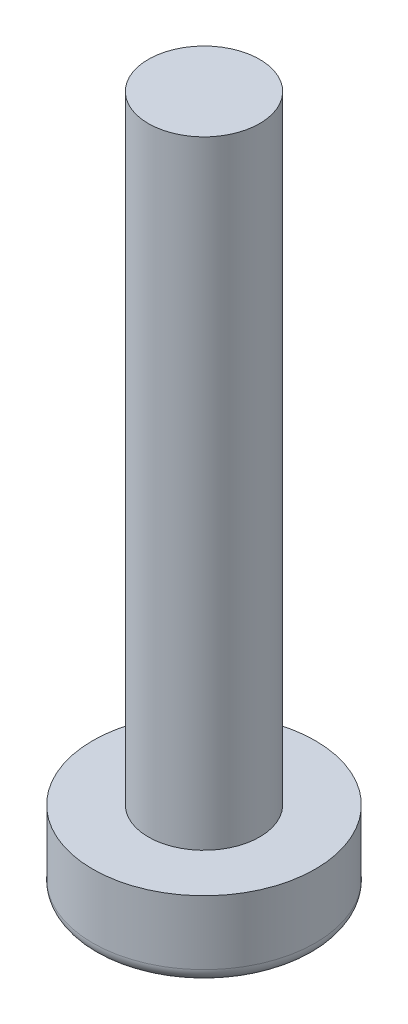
ISO-10303-21;
HEADER;
FILE_DESCRIPTION(('STEP AP214'),'2;1');
FILE_NAME('part.step','',(''),(''),'','','');
FILE_SCHEMA(('AUTOMOTIVE_DESIGN { 1 0 10303 214 1 1 1 1 }'));
ENDSEC;
DATA;
#1=APPLICATION_CONTEXT('core data for automotive mechanical design processes');
#2=APPLICATION_PROTOCOL_DEFINITION('international standard','automotive_design',2000,#1);
#3=PRODUCT_CONTEXT('',#1,'mechanical');
#4=PRODUCT('Part','Part','',(#3));
#5=PRODUCT_RELATED_PRODUCT_CATEGORY('part','',(#4));
#6=PRODUCT_DEFINITION_FORMATION('','',#4);
#7=PRODUCT_DEFINITION_CONTEXT('part definition',#1,'design');
#8=PRODUCT_DEFINITION('design','',#6,#7);
#9=PRODUCT_DEFINITION_SHAPE('','',#8);
#10=(LENGTH_UNIT() NAMED_UNIT(*) SI_UNIT(.MILLI.,.METRE.));
#11=(NAMED_UNIT(*) PLANE_ANGLE_UNIT() SI_UNIT($,.RADIAN.));
#12=(NAMED_UNIT(*) SI_UNIT($,.STERADIAN.) SOLID_ANGLE_UNIT());
#13=UNCERTAINTY_MEASURE_WITH_UNIT(LENGTH_MEASURE(1.E-05),#10,'distance_accuracy_value','');
#14=(GEOMETRIC_REPRESENTATION_CONTEXT(3) GLOBAL_UNCERTAINTY_ASSIGNED_CONTEXT((#13)) GLOBAL_UNIT_ASSIGNED_CONTEXT((#10,
#11,#12)) REPRESENTATION_CONTEXT('',''));
#15=CARTESIAN_POINT('',(0.,0.,0.));
#16=DIRECTION('',(0.,0.,1.));
#17=DIRECTION('',(1.,0.,0.));
#18=AXIS2_PLACEMENT_3D('',#15,#16,#17);
#19=CARTESIAN_POINT('',(0.,0.,0.));
#20=DIRECTION('',(0.,1.,0.));
#21=DIRECTION('',(0.,0.,1.));
#22=AXIS2_PLACEMENT_3D('',#19,#20,#21);
#23=PLANE('',#22);
#24=CARTESIAN_POINT('',(0.,0.,0.));
#25=DIRECTION('',(0.,1.,0.));
#26=DIRECTION('',(0.,0.,1.));
#27=AXIS2_PLACEMENT_3D('',#24,#25,#26);
#28=CIRCLE('',#27,3.5);
#29=CARTESIAN_POINT('',(0.,0.,3.5));
#30=VERTEX_POINT('',#29);
#31=EDGE_CURVE('E11',#30,#30,#28,.F.);
#32=ORIENTED_EDGE('',*,*,#31,.T.);
#33=EDGE_LOOP('',(#32));
#34=FACE_BOUND('',#33,.T.);
#35=ADVANCED_FACE('F47',(#34),#23,.F.);
#36=CARTESIAN_POINT('',(0.,2.8,0.));
#37=DIRECTION('',(0.,-1.,0.));
#38=DIRECTION('',(0.,0.,-1.));
#39=AXIS2_PLACEMENT_3D('',#36,#37,#38);
#40=CYLINDRICAL_SURFACE('',#39,4.);
#41=CARTESIAN_POINT('',(0.,0.5,0.));
#42=DIRECTION('',(0.,1.,0.));
#43=DIRECTION('',(0.,0.,1.));
#44=AXIS2_PLACEMENT_3D('',#41,#42,#43);
#45=CIRCLE('',#44,4.);
#46=CARTESIAN_POINT('',(0.,0.5,4.));
#47=VERTEX_POINT('',#46);
#48=EDGE_CURVE('E60',#47,#47,#45,.T.);
#49=ORIENTED_EDGE('',*,*,#48,.T.);
#50=EDGE_LOOP('',(#49));
#51=FACE_BOUND('',#50,.T.);
#52=CARTESIAN_POINT('',(0.,2.8,0.));
#53=DIRECTION('',(0.,1.,0.));
#54=DIRECTION('',(0.,0.,1.));
#55=AXIS2_PLACEMENT_3D('',#52,#53,#54);
#56=CIRCLE('',#55,4.);
#57=CARTESIAN_POINT('',(0.,2.8,4.));
#58=VERTEX_POINT('',#57);
#59=EDGE_CURVE('E67',#58,#58,#56,.T.);
#60=ORIENTED_EDGE('',*,*,#59,.F.);
#61=EDGE_LOOP('',(#60));
#62=FACE_BOUND('',#61,.T.);
#63=ADVANCED_FACE('F90',(#51,#62),#40,.T.);
#64=CARTESIAN_POINT('',(0.,2.8,0.));
#65=DIRECTION('',(0.,1.,0.));
#66=DIRECTION('',(0.,0.,1.));
#67=AXIS2_PLACEMENT_3D('',#64,#65,#66);
#68=PLANE('',#67);
#69=CARTESIAN_POINT('',(0.,2.8,0.));
#70=DIRECTION('',(0.,1.,0.));
#71=DIRECTION('',(0.,0.,1.));
#72=AXIS2_PLACEMENT_3D('',#69,#70,#71);
#73=CIRCLE('',#72,2.);
#74=CARTESIAN_POINT('',(0.,2.8,2.));
#75=VERTEX_POINT('',#74);
#76=EDGE_CURVE('E64',#75,#75,#73,.T.);
#77=ORIENTED_EDGE('',*,*,#76,.F.);
#78=EDGE_LOOP('',(#77));
#79=FACE_BOUND('',#78,.T.);
#80=ORIENTED_EDGE('',*,*,#59,.T.);
#81=EDGE_LOOP('',(#80));
#82=FACE_BOUND('',#81,.T.);
#83=ADVANCED_FACE('F84',(#79,#82),#68,.T.);
#84=CARTESIAN_POINT('',(0.,25.,0.));
#85=DIRECTION('',(0.,-1.,0.));
#86=DIRECTION('',(0.,0.,-1.));
#87=AXIS2_PLACEMENT_3D('',#84,#85,#86);
#88=CYLINDRICAL_SURFACE('',#87,2.);
#89=CARTESIAN_POINT('',(0.,25.,0.));
#90=DIRECTION('',(0.,1.,0.));
#91=DIRECTION('',(0.,0.,1.));
#92=AXIS2_PLACEMENT_3D('',#89,#90,#91);
#93=CIRCLE('',#92,2.);
#94=CARTESIAN_POINT('',(0.,25.,2.));
#95=VERTEX_POINT('',#94);
#96=EDGE_CURVE('E75',#95,#95,#93,.T.);
#97=ORIENTED_EDGE('',*,*,#96,.F.);
#98=EDGE_LOOP('',(#97));
#99=FACE_BOUND('',#98,.T.);
#100=ORIENTED_EDGE('',*,*,#76,.T.);
#101=EDGE_LOOP('',(#100));
#102=FACE_BOUND('',#101,.T.);
#103=ADVANCED_FACE('F76',(#99,#102),#88,.T.);
#104=CARTESIAN_POINT('',(0.,25.,0.));
#105=DIRECTION('',(0.,1.,0.));
#106=DIRECTION('',(0.,0.,1.));
#107=AXIS2_PLACEMENT_3D('',#104,#105,#106);
#108=PLANE('',#107);
#109=ORIENTED_EDGE('',*,*,#96,.T.);
#110=EDGE_LOOP('',(#109));
#111=FACE_BOUND('',#110,.T.);
#112=ADVANCED_FACE('F77',(#111),#108,.T.);
#113=CARTESIAN_POINT('',(0.,0.5,0.));
#114=DIRECTION('',(0.,1.,0.));
#115=DIRECTION('',(0.,0.,1.));
#116=AXIS2_PLACEMENT_3D('',#113,#114,#115);
#117=TOROIDAL_SURFACE('',#116,3.5,0.5);
#118=ORIENTED_EDGE('',*,*,#31,.F.);
#119=EDGE_LOOP('',(#118));
#120=FACE_BOUND('',#119,.T.);
#121=ORIENTED_EDGE('',*,*,#48,.F.);
#122=EDGE_LOOP('',(#121));
#123=FACE_BOUND('',#122,.T.);
#124=ADVANCED_FACE('F51',(#120,#123),#117,.T.);
#125=CLOSED_SHELL('',(#35,#63,#83,#103,#112,#124));
#126=MANIFOLD_SOLID_BREP('B2',#125);
#127=ADVANCED_BREP_SHAPE_REPRESENTATION('',(#18,#126),#14);
#128=SHAPE_DEFINITION_REPRESENTATION(#9,#127);
ENDSEC;
END-ISO-10303-21;
